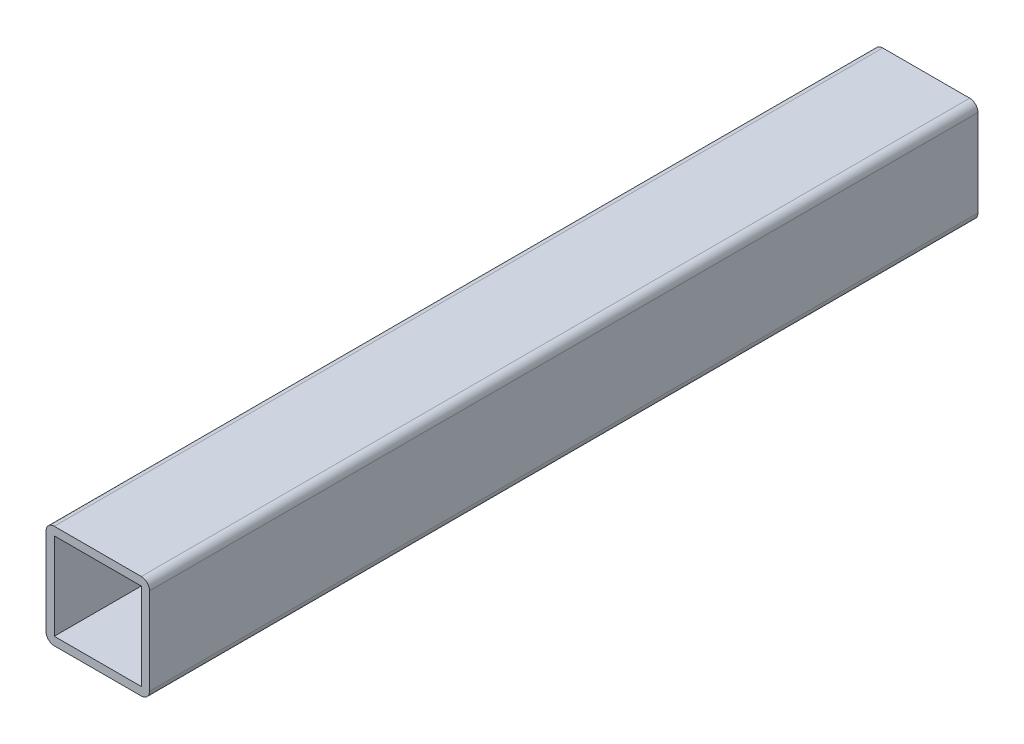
ISO-10303-21;
HEADER;
FILE_DESCRIPTION(('STEP AP214'),'2;1');
FILE_NAME('part.step','',(''),(''),'','','');
FILE_SCHEMA(('AUTOMOTIVE_DESIGN { 1 0 10303 214 1 1 1 1 }'));
ENDSEC;
DATA;
#1=APPLICATION_CONTEXT('core data for automotive mechanical design processes');
#2=APPLICATION_PROTOCOL_DEFINITION('international standard','automotive_design',2000,#1);
#3=PRODUCT_CONTEXT('',#1,'mechanical');
#4=PRODUCT('Part','Part','',(#3));
#5=PRODUCT_RELATED_PRODUCT_CATEGORY('part','',(#4));
#6=PRODUCT_DEFINITION_FORMATION('','',#4);
#7=PRODUCT_DEFINITION_CONTEXT('part definition',#1,'design');
#8=PRODUCT_DEFINITION('design','',#6,#7);
#9=PRODUCT_DEFINITION_SHAPE('','',#8);
#10=(LENGTH_UNIT() NAMED_UNIT(*) SI_UNIT(.MILLI.,.METRE.));
#11=(NAMED_UNIT(*) PLANE_ANGLE_UNIT() SI_UNIT($,.RADIAN.));
#12=(NAMED_UNIT(*) SI_UNIT($,.STERADIAN.) SOLID_ANGLE_UNIT());
#13=UNCERTAINTY_MEASURE_WITH_UNIT(LENGTH_MEASURE(1.E-05),#10,'distance_accuracy_value','');
#14=(GEOMETRIC_REPRESENTATION_CONTEXT(3) GLOBAL_UNCERTAINTY_ASSIGNED_CONTEXT((#13)) GLOBAL_UNIT_ASSIGNED_CONTEXT((#10,
#11,#12)) REPRESENTATION_CONTEXT('',''));
#15=CARTESIAN_POINT('',(0.,0.,0.));
#16=DIRECTION('',(0.,0.,1.));
#17=DIRECTION('',(1.,0.,0.));
#18=AXIS2_PLACEMENT_3D('',#15,#16,#17);
#19=CARTESIAN_POINT('',(-23.,-2.,200.));
#20=DIRECTION('',(0.,0.,1.));
#21=DIRECTION('',(1.,0.,0.));
#22=AXIS2_PLACEMENT_3D('',#19,#20,#21);
#23=PLANE('',#22);
#24=CARTESIAN_POINT('',(-23.,-2.,200.));
#25=DIRECTION('',(0.,0.,1.));
#26=DIRECTION('',(1.,0.,0.));
#27=AXIS2_PLACEMENT_3D('',#24,#25,#26);
#28=CIRCLE('',#27,2.);
#29=CARTESIAN_POINT('',(-23.,0.,200.));
#30=VERTEX_POINT('',#29);
#31=CARTESIAN_POINT('',(-25.,-2.00000000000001,200.));
#32=VERTEX_POINT('',#31);
#33=EDGE_CURVE('E159',#30,#32,#28,.T.);
#34=ORIENTED_EDGE('',*,*,#33,.T.);
#35=DIRECTION('',(0.,-1.,0.));
#36=VECTOR('',#35,1.);
#37=CARTESIAN_POINT('',(-25.,-2.00000000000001,200.));
#38=LINE('',#37,#36);
#39=CARTESIAN_POINT('',(-25.,-23.,200.));
#40=VERTEX_POINT('',#39);
#41=EDGE_CURVE('E162',#32,#40,#38,.T.);
#42=ORIENTED_EDGE('',*,*,#41,.T.);
#43=CARTESIAN_POINT('',(-23.,-23.,200.));
#44=DIRECTION('',(0.,0.,1.));
#45=DIRECTION('',(-1.,0.,0.));
#46=AXIS2_PLACEMENT_3D('',#43,#44,#45);
#47=CIRCLE('',#46,2.);
#48=CARTESIAN_POINT('',(-23.,-25.,200.));
#49=VERTEX_POINT('',#48);
#50=EDGE_CURVE('E165',#40,#49,#47,.T.);
#51=ORIENTED_EDGE('',*,*,#50,.T.);
#52=DIRECTION('',(1.,0.,0.));
#53=VECTOR('',#52,1.);
#54=CARTESIAN_POINT('',(-2.00000000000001,-25.,200.));
#55=LINE('',#54,#53);
#56=CARTESIAN_POINT('',(-2.00000000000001,-25.,200.));
#57=VERTEX_POINT('',#56);
#58=EDGE_CURVE('E167',#49,#57,#55,.T.);
#59=ORIENTED_EDGE('',*,*,#58,.T.);
#60=CARTESIAN_POINT('',(-2.,-23.,200.));
#61=DIRECTION('',(0.,0.,1.));
#62=DIRECTION('',(-1.,0.,0.));
#63=AXIS2_PLACEMENT_3D('',#60,#61,#62);
#64=CIRCLE('',#63,2.);
#65=CARTESIAN_POINT('',(0.,-23.,200.));
#66=VERTEX_POINT('',#65);
#67=EDGE_CURVE('E169',#57,#66,#64,.T.);
#68=ORIENTED_EDGE('',*,*,#67,.T.);
#69=DIRECTION('',(0.,1.,0.));
#70=VECTOR('',#69,1.);
#71=CARTESIAN_POINT('',(0.,-2.00000000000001,200.));
#72=LINE('',#71,#70);
#73=CARTESIAN_POINT('',(0.,-2.00000000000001,200.));
#74=VERTEX_POINT('',#73);
#75=EDGE_CURVE('E171',#66,#74,#72,.T.);
#76=ORIENTED_EDGE('',*,*,#75,.T.);
#77=CARTESIAN_POINT('',(-2.,-2.,200.));
#78=DIRECTION('',(0.,0.,1.));
#79=DIRECTION('',(-1.,0.,0.));
#80=AXIS2_PLACEMENT_3D('',#77,#78,#79);
#81=CIRCLE('',#80,2.);
#82=CARTESIAN_POINT('',(-2.00000000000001,0.,200.));
#83=VERTEX_POINT('',#82);
#84=EDGE_CURVE('E173',#74,#83,#81,.T.);
#85=ORIENTED_EDGE('',*,*,#84,.T.);
#86=DIRECTION('',(-1.,0.,0.));
#87=VECTOR('',#86,1.);
#88=CARTESIAN_POINT('',(-2.00000000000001,0.,200.));
#89=LINE('',#88,#87);
#90=EDGE_CURVE('E175',#83,#30,#89,.T.);
#91=ORIENTED_EDGE('',*,*,#90,.T.);
#92=EDGE_LOOP('',(#34,#42,#51,#59,#68,#76,#85,#91));
#93=FACE_BOUND('',#92,.T.);
#94=DIRECTION('',(-1.,0.,0.));
#95=VECTOR('',#94,1.);
#96=CARTESIAN_POINT('',(-2.00000000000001,-2.,200.));
#97=LINE('',#96,#95);
#98=CARTESIAN_POINT('',(-2.00000000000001,-2.,200.));
#99=VERTEX_POINT('',#98);
#100=CARTESIAN_POINT('',(-23.,-2.,200.));
#101=VERTEX_POINT('',#100);
#102=EDGE_CURVE('E131',#99,#101,#97,.T.);
#103=ORIENTED_EDGE('',*,*,#102,.F.);
#104=DIRECTION('',(0.,1.,0.));
#105=VECTOR('',#104,1.);
#106=CARTESIAN_POINT('',(-2.,-2.00000000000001,200.));
#107=LINE('',#106,#105);
#108=CARTESIAN_POINT('',(-2.00000000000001,-23.,200.));
#109=VERTEX_POINT('',#108);
#110=EDGE_CURVE('E123',#109,#99,#107,.T.);
#111=ORIENTED_EDGE('',*,*,#110,.F.);
#112=DIRECTION('',(1.,0.,0.));
#113=VECTOR('',#112,1.);
#114=CARTESIAN_POINT('',(-2.00000000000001,-23.,200.));
#115=LINE('',#114,#113);
#116=CARTESIAN_POINT('',(-23.,-23.,200.));
#117=VERTEX_POINT('',#116);
#118=EDGE_CURVE('E145',#117,#109,#115,.T.);
#119=ORIENTED_EDGE('',*,*,#118,.F.);
#120=DIRECTION('',(0.,-1.,0.));
#121=VECTOR('',#120,1.);
#122=CARTESIAN_POINT('',(-23.,-2.,200.));
#123=LINE('',#122,#121);
#124=EDGE_CURVE('E143',#101,#117,#123,.T.);
#125=ORIENTED_EDGE('',*,*,#124,.F.);
#126=EDGE_LOOP('',(#103,#111,#119,#125));
#127=FACE_BOUND('',#126,.T.);
#128=ADVANCED_FACE('F34',(#93,#127),#23,.T.);
#129=CARTESIAN_POINT('',(-23.,-2.,0.));
#130=DIRECTION('',(0.,0.,1.));
#131=DIRECTION('',(1.,0.,0.));
#132=AXIS2_PLACEMENT_3D('',#129,#130,#131);
#133=PLANE('',#132);
#134=CARTESIAN_POINT('',(-23.,-2.,0.));
#135=DIRECTION('',(0.,0.,1.));
#136=DIRECTION('',(1.,0.,0.));
#137=AXIS2_PLACEMENT_3D('',#134,#135,#136);
#138=CIRCLE('',#137,2.);
#139=CARTESIAN_POINT('',(-23.,0.,0.));
#140=VERTEX_POINT('',#139);
#141=CARTESIAN_POINT('',(-25.,-2.00000000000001,0.));
#142=VERTEX_POINT('',#141);
#143=EDGE_CURVE('E139',#140,#142,#138,.T.);
#144=ORIENTED_EDGE('',*,*,#143,.F.);
#145=DIRECTION('',(-1.,0.,0.));
#146=VECTOR('',#145,1.);
#147=CARTESIAN_POINT('',(-2.00000000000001,0.,0.));
#148=LINE('',#147,#146);
#149=CARTESIAN_POINT('',(-2.00000000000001,0.,0.));
#150=VERTEX_POINT('',#149);
#151=EDGE_CURVE('E163',#150,#140,#148,.T.);
#152=ORIENTED_EDGE('',*,*,#151,.F.);
#153=CARTESIAN_POINT('',(-2.,-2.,0.));
#154=DIRECTION('',(0.,0.,1.));
#155=DIRECTION('',(-1.,0.,0.));
#156=AXIS2_PLACEMENT_3D('',#153,#154,#155);
#157=CIRCLE('',#156,2.);
#158=CARTESIAN_POINT('',(0.,-2.00000000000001,0.));
#159=VERTEX_POINT('',#158);
#160=EDGE_CURVE('E190',#159,#150,#157,.T.);
#161=ORIENTED_EDGE('',*,*,#160,.F.);
#162=DIRECTION('',(0.,1.,0.));
#163=VECTOR('',#162,1.);
#164=CARTESIAN_POINT('',(0.,-2.00000000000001,0.));
#165=LINE('',#164,#163);
#166=CARTESIAN_POINT('',(0.,-23.,0.));
#167=VERTEX_POINT('',#166);
#168=EDGE_CURVE('E188',#167,#159,#165,.T.);
#169=ORIENTED_EDGE('',*,*,#168,.F.);
#170=CARTESIAN_POINT('',(-2.,-23.,0.));
#171=DIRECTION('',(0.,0.,1.));
#172=DIRECTION('',(-1.,0.,0.));
#173=AXIS2_PLACEMENT_3D('',#170,#171,#172);
#174=CIRCLE('',#173,2.);
#175=CARTESIAN_POINT('',(-2.00000000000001,-25.,0.));
#176=VERTEX_POINT('',#175);
#177=EDGE_CURVE('E186',#176,#167,#174,.T.);
#178=ORIENTED_EDGE('',*,*,#177,.F.);
#179=DIRECTION('',(1.,0.,0.));
#180=VECTOR('',#179,1.);
#181=CARTESIAN_POINT('',(-2.00000000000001,-25.,0.));
#182=LINE('',#181,#180);
#183=CARTESIAN_POINT('',(-23.,-25.,0.));
#184=VERTEX_POINT('',#183);
#185=EDGE_CURVE('E184',#184,#176,#182,.T.);
#186=ORIENTED_EDGE('',*,*,#185,.F.);
#187=CARTESIAN_POINT('',(-23.,-23.,0.));
#188=DIRECTION('',(0.,0.,1.));
#189=DIRECTION('',(-1.,0.,0.));
#190=AXIS2_PLACEMENT_3D('',#187,#188,#189);
#191=CIRCLE('',#190,2.);
#192=CARTESIAN_POINT('',(-25.,-23.,0.));
#193=VERTEX_POINT('',#192);
#194=EDGE_CURVE('E182',#193,#184,#191,.T.);
#195=ORIENTED_EDGE('',*,*,#194,.F.);
#196=DIRECTION('',(0.,-1.,0.));
#197=VECTOR('',#196,1.);
#198=CARTESIAN_POINT('',(-25.,-2.00000000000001,0.));
#199=LINE('',#198,#197);
#200=EDGE_CURVE('E180',#142,#193,#199,.T.);
#201=ORIENTED_EDGE('',*,*,#200,.F.);
#202=EDGE_LOOP('',(#144,#152,#161,#169,#178,#186,#195,#201));
#203=FACE_BOUND('',#202,.T.);
#204=DIRECTION('',(0.,1.,0.));
#205=VECTOR('',#204,1.);
#206=CARTESIAN_POINT('',(-2.,-2.00000000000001,0.));
#207=LINE('',#206,#205);
#208=CARTESIAN_POINT('',(-2.00000000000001,-23.,0.));
#209=VERTEX_POINT('',#208);
#210=CARTESIAN_POINT('',(-2.00000000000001,-2.,0.));
#211=VERTEX_POINT('',#210);
#212=EDGE_CURVE('E57',#209,#211,#207,.T.);
#213=ORIENTED_EDGE('',*,*,#212,.T.);
#214=DIRECTION('',(-1.,0.,0.));
#215=VECTOR('',#214,1.);
#216=CARTESIAN_POINT('',(-2.00000000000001,-2.,0.));
#217=LINE('',#216,#215);
#218=CARTESIAN_POINT('',(-23.,-2.,0.));
#219=VERTEX_POINT('',#218);
#220=EDGE_CURVE('E138',#211,#219,#217,.T.);
#221=ORIENTED_EDGE('',*,*,#220,.T.);
#222=DIRECTION('',(0.,-1.,0.));
#223=VECTOR('',#222,1.);
#224=CARTESIAN_POINT('',(-23.,-2.,0.));
#225=LINE('',#224,#223);
#226=CARTESIAN_POINT('',(-23.,-23.,0.));
#227=VERTEX_POINT('',#226);
#228=EDGE_CURVE('E151',#219,#227,#225,.T.);
#229=ORIENTED_EDGE('',*,*,#228,.T.);
#230=DIRECTION('',(1.,0.,0.));
#231=VECTOR('',#230,1.);
#232=CARTESIAN_POINT('',(-2.00000000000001,-23.,0.));
#233=LINE('',#232,#231);
#234=EDGE_CURVE('E132',#227,#209,#233,.T.);
#235=ORIENTED_EDGE('',*,*,#234,.T.);
#236=EDGE_LOOP('',(#213,#221,#229,#235));
#237=FACE_BOUND('',#236,.T.);
#238=ADVANCED_FACE('F220',(#203,#237),#133,.F.);
#239=CARTESIAN_POINT('',(-23.,-2.,200.));
#240=DIRECTION('',(0.,0.,-1.));
#241=DIRECTION('',(-1.,0.,0.));
#242=AXIS2_PLACEMENT_3D('',#239,#240,#241);
#243=CYLINDRICAL_SURFACE('',#242,2.);
#244=ORIENTED_EDGE('',*,*,#143,.T.);
#245=DIRECTION('',(0.,0.,-1.));
#246=VECTOR('',#245,1.);
#247=CARTESIAN_POINT('',(-25.,-2.00000000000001,200.));
#248=LINE('',#247,#246);
#249=EDGE_CURVE('E11',#32,#142,#248,.T.);
#250=ORIENTED_EDGE('',*,*,#249,.F.);
#251=ORIENTED_EDGE('',*,*,#33,.F.);
#252=DIRECTION('',(0.,0.,-1.));
#253=VECTOR('',#252,1.);
#254=CARTESIAN_POINT('',(-23.,0.,200.));
#255=LINE('',#254,#253);
#256=EDGE_CURVE('E177',#30,#140,#255,.T.);
#257=ORIENTED_EDGE('',*,*,#256,.T.);
#258=EDGE_LOOP('',(#244,#250,#251,#257));
#259=FACE_BOUND('',#258,.T.);
#260=ADVANCED_FACE('F36',(#259),#243,.T.);
#261=CARTESIAN_POINT('',(-25.,-2.00000000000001,200.));
#262=DIRECTION('',(1.,0.,0.));
#263=DIRECTION('',(0.,1.,0.));
#264=AXIS2_PLACEMENT_3D('',#261,#262,#263);
#265=PLANE('',#264);
#266=ORIENTED_EDGE('',*,*,#200,.T.);
#267=DIRECTION('',(0.,0.,-1.));
#268=VECTOR('',#267,1.);
#269=CARTESIAN_POINT('',(-25.,-23.,200.));
#270=LINE('',#269,#268);
#271=EDGE_CURVE('E42',#40,#193,#270,.T.);
#272=ORIENTED_EDGE('',*,*,#271,.F.);
#273=ORIENTED_EDGE('',*,*,#41,.F.);
#274=ORIENTED_EDGE('',*,*,#249,.T.);
#275=EDGE_LOOP('',(#266,#272,#273,#274));
#276=FACE_BOUND('',#275,.T.);
#277=ADVANCED_FACE('F237',(#276),#265,.F.);
#278=CARTESIAN_POINT('',(-23.,-23.,200.));
#279=DIRECTION('',(0.,0.,-1.));
#280=DIRECTION('',(-1.,0.,0.));
#281=AXIS2_PLACEMENT_3D('',#278,#279,#280);
#282=CYLINDRICAL_SURFACE('',#281,2.);
#283=ORIENTED_EDGE('',*,*,#194,.T.);
#284=DIRECTION('',(0.,0.,-1.));
#285=VECTOR('',#284,1.);
#286=CARTESIAN_POINT('',(-23.,-25.,200.));
#287=LINE('',#286,#285);
#288=EDGE_CURVE('E207',#49,#184,#287,.T.);
#289=ORIENTED_EDGE('',*,*,#288,.F.);
#290=ORIENTED_EDGE('',*,*,#50,.F.);
#291=ORIENTED_EDGE('',*,*,#271,.T.);
#292=EDGE_LOOP('',(#283,#289,#290,#291));
#293=FACE_BOUND('',#292,.T.);
#294=ADVANCED_FACE('F214',(#293),#282,.T.);
#295=CARTESIAN_POINT('',(-2.00000000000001,-25.,200.));
#296=DIRECTION('',(0.,1.,0.));
#297=DIRECTION('',(-1.,0.,0.));
#298=AXIS2_PLACEMENT_3D('',#295,#296,#297);
#299=PLANE('',#298);
#300=ORIENTED_EDGE('',*,*,#185,.T.);
#301=DIRECTION('',(0.,0.,-1.));
#302=VECTOR('',#301,1.);
#303=CARTESIAN_POINT('',(-2.00000000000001,-25.,200.));
#304=LINE('',#303,#302);
#305=EDGE_CURVE('E204',#57,#176,#304,.T.);
#306=ORIENTED_EDGE('',*,*,#305,.F.);
#307=ORIENTED_EDGE('',*,*,#58,.F.);
#308=ORIENTED_EDGE('',*,*,#288,.T.);
#309=EDGE_LOOP('',(#300,#306,#307,#308));
#310=FACE_BOUND('',#309,.T.);
#311=ADVANCED_FACE('F226',(#310),#299,.F.);
#312=CARTESIAN_POINT('',(-2.,-23.,200.));
#313=DIRECTION('',(0.,0.,-1.));
#314=DIRECTION('',(-1.,0.,0.));
#315=AXIS2_PLACEMENT_3D('',#312,#313,#314);
#316=CYLINDRICAL_SURFACE('',#315,2.);
#317=ORIENTED_EDGE('',*,*,#177,.T.);
#318=DIRECTION('',(0.,0.,-1.));
#319=VECTOR('',#318,1.);
#320=CARTESIAN_POINT('',(0.,-23.,200.));
#321=LINE('',#320,#319);
#322=EDGE_CURVE('E201',#66,#167,#321,.T.);
#323=ORIENTED_EDGE('',*,*,#322,.F.);
#324=ORIENTED_EDGE('',*,*,#67,.F.);
#325=ORIENTED_EDGE('',*,*,#305,.T.);
#326=EDGE_LOOP('',(#317,#323,#324,#325));
#327=FACE_BOUND('',#326,.T.);
#328=ADVANCED_FACE('F230',(#327),#316,.T.);
#329=CARTESIAN_POINT('',(0.,-2.00000000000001,200.));
#330=DIRECTION('',(-1.,0.,0.));
#331=DIRECTION('',(0.,-1.,0.));
#332=AXIS2_PLACEMENT_3D('',#329,#330,#331);
#333=PLANE('',#332);
#334=ORIENTED_EDGE('',*,*,#168,.T.);
#335=DIRECTION('',(0.,0.,-1.));
#336=VECTOR('',#335,1.);
#337=CARTESIAN_POINT('',(0.,-2.00000000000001,200.));
#338=LINE('',#337,#336);
#339=EDGE_CURVE('E198',#74,#159,#338,.T.);
#340=ORIENTED_EDGE('',*,*,#339,.F.);
#341=ORIENTED_EDGE('',*,*,#75,.F.);
#342=ORIENTED_EDGE('',*,*,#322,.T.);
#343=EDGE_LOOP('',(#334,#340,#341,#342));
#344=FACE_BOUND('',#343,.T.);
#345=ADVANCED_FACE('F250',(#344),#333,.F.);
#346=CARTESIAN_POINT('',(-2.,-2.,200.));
#347=DIRECTION('',(0.,0.,-1.));
#348=DIRECTION('',(-1.,0.,0.));
#349=AXIS2_PLACEMENT_3D('',#346,#347,#348);
#350=CYLINDRICAL_SURFACE('',#349,2.);
#351=ORIENTED_EDGE('',*,*,#160,.T.);
#352=DIRECTION('',(0.,0.,-1.));
#353=VECTOR('',#352,1.);
#354=CARTESIAN_POINT('',(-2.00000000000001,0.,200.));
#355=LINE('',#354,#353);
#356=EDGE_CURVE('E195',#83,#150,#355,.T.);
#357=ORIENTED_EDGE('',*,*,#356,.F.);
#358=ORIENTED_EDGE('',*,*,#84,.F.);
#359=ORIENTED_EDGE('',*,*,#339,.T.);
#360=EDGE_LOOP('',(#351,#357,#358,#359));
#361=FACE_BOUND('',#360,.T.);
#362=ADVANCED_FACE('F248',(#361),#350,.T.);
#363=CARTESIAN_POINT('',(-2.00000000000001,0.,200.));
#364=DIRECTION('',(0.,-1.,0.));
#365=DIRECTION('',(0.,0.,-1.));
#366=AXIS2_PLACEMENT_3D('',#363,#364,#365);
#367=PLANE('',#366);
#368=ORIENTED_EDGE('',*,*,#151,.T.);
#369=ORIENTED_EDGE('',*,*,#256,.F.);
#370=ORIENTED_EDGE('',*,*,#90,.F.);
#371=ORIENTED_EDGE('',*,*,#356,.T.);
#372=EDGE_LOOP('',(#368,#369,#370,#371));
#373=FACE_BOUND('',#372,.T.);
#374=ADVANCED_FACE('F243',(#373),#367,.F.);
#375=CARTESIAN_POINT('',(-2.,-2.00000000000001,200.));
#376=DIRECTION('',(-1.,0.,0.));
#377=DIRECTION('',(0.,-1.,0.));
#378=AXIS2_PLACEMENT_3D('',#375,#376,#377);
#379=PLANE('',#378);
#380=ORIENTED_EDGE('',*,*,#212,.F.);
#381=DIRECTION('',(0.,0.,-1.));
#382=VECTOR('',#381,1.);
#383=CARTESIAN_POINT('',(-2.00000000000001,-23.,200.));
#384=LINE('',#383,#382);
#385=EDGE_CURVE('E127',#109,#209,#384,.T.);
#386=ORIENTED_EDGE('',*,*,#385,.F.);
#387=ORIENTED_EDGE('',*,*,#110,.T.);
#388=DIRECTION('',(0.,0.,-1.));
#389=VECTOR('',#388,1.);
#390=CARTESIAN_POINT('',(-2.00000000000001,-2.,200.));
#391=LINE('',#390,#389);
#392=EDGE_CURVE('E126',#99,#211,#391,.T.);
#393=ORIENTED_EDGE('',*,*,#392,.T.);
#394=EDGE_LOOP('',(#380,#386,#387,#393));
#395=FACE_BOUND('',#394,.T.);
#396=ADVANCED_FACE('F125',(#395),#379,.T.);
#397=CARTESIAN_POINT('',(-2.00000000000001,-2.,200.));
#398=DIRECTION('',(0.,-1.,0.));
#399=DIRECTION('',(0.,0.,-1.));
#400=AXIS2_PLACEMENT_3D('',#397,#398,#399);
#401=PLANE('',#400);
#402=ORIENTED_EDGE('',*,*,#220,.F.);
#403=ORIENTED_EDGE('',*,*,#392,.F.);
#404=ORIENTED_EDGE('',*,*,#102,.T.);
#405=DIRECTION('',(0.,0.,-1.));
#406=VECTOR('',#405,1.);
#407=CARTESIAN_POINT('',(-23.,-2.,200.));
#408=LINE('',#407,#406);
#409=EDGE_CURVE('E140',#101,#219,#408,.T.);
#410=ORIENTED_EDGE('',*,*,#409,.T.);
#411=EDGE_LOOP('',(#402,#403,#404,#410));
#412=FACE_BOUND('',#411,.T.);
#413=ADVANCED_FACE('F135',(#412),#401,.T.);
#414=CARTESIAN_POINT('',(-23.,-2.,200.));
#415=DIRECTION('',(1.,0.,0.));
#416=DIRECTION('',(0.,1.,0.));
#417=AXIS2_PLACEMENT_3D('',#414,#415,#416);
#418=PLANE('',#417);
#419=ORIENTED_EDGE('',*,*,#228,.F.);
#420=ORIENTED_EDGE('',*,*,#409,.F.);
#421=ORIENTED_EDGE('',*,*,#124,.T.);
#422=DIRECTION('',(0.,0.,-1.));
#423=VECTOR('',#422,1.);
#424=CARTESIAN_POINT('',(-23.,-23.,200.));
#425=LINE('',#424,#423);
#426=EDGE_CURVE('E49',#117,#227,#425,.T.);
#427=ORIENTED_EDGE('',*,*,#426,.T.);
#428=EDGE_LOOP('',(#419,#420,#421,#427));
#429=FACE_BOUND('',#428,.T.);
#430=ADVANCED_FACE('F275',(#429),#418,.T.);
#431=CARTESIAN_POINT('',(-2.00000000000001,-23.,200.));
#432=DIRECTION('',(0.,1.,0.));
#433=DIRECTION('',(-1.,0.,0.));
#434=AXIS2_PLACEMENT_3D('',#431,#432,#433);
#435=PLANE('',#434);
#436=ORIENTED_EDGE('',*,*,#234,.F.);
#437=ORIENTED_EDGE('',*,*,#426,.F.);
#438=ORIENTED_EDGE('',*,*,#118,.T.);
#439=ORIENTED_EDGE('',*,*,#385,.T.);
#440=EDGE_LOOP('',(#436,#437,#438,#439));
#441=FACE_BOUND('',#440,.T.);
#442=ADVANCED_FACE('F279',(#441),#435,.T.);
#443=CLOSED_SHELL('',(#128,#238,#260,#277,#294,#311,#328,#345,#362,#374,#396,#413,#430,#442));
#444=MANIFOLD_SOLID_BREP('B2',#443);
#445=ADVANCED_BREP_SHAPE_REPRESENTATION('',(#18,#444),#14);
#446=SHAPE_DEFINITION_REPRESENTATION(#9,#445);
ENDSEC;
END-ISO-10303-21;
